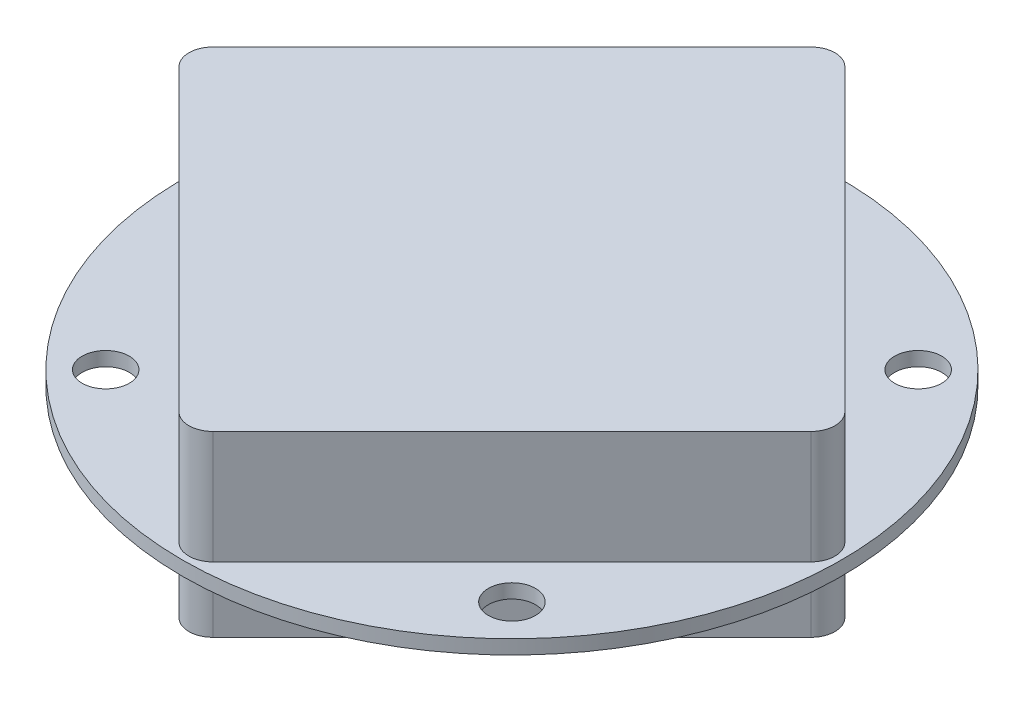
from build123d import *

# Parameters (mm, degrees)
SKETCH1_R                  = 17.5
BOSS_EXTRUDE1_DEPTH        = 0.75
BOSS_EXTRUDE2_DEPTH        = 6
BOSS_EXTRUDE3_START        = 2.72
BOSS_EXTRUDE3_DEPTH        = 2.72
F_2_5_2_5_DIAMETER_HOLE1_D = 2.5


with BuildPart() as part:
    # Sketch1 → Boss-Extrude1 (new body)
    with BuildSketch(Plane(origin=(0, 0, 0), x_dir=(1, 0, 0), z_dir=(0, 1, 0))):
        with Locations(Location((0, 0, 0), (0, 0, 270))):
            Circle(SKETCH1_R)
    extrude(amount=BOSS_EXTRUDE1_DEPTH)

    # Sketch2 → Boss-Extrude2 (add)
    with BuildSketch(Plane(origin=(0, 0.75, 0), x_dir=(1, 0, 0), z_dir=(0, 1, 0))):
        with BuildLine():
            Line((-16.779643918, 0.898025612), (-0.898025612, 16.779643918))
            ThreePointArc((-0.898025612, 16.779643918), (0, 17.151618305), (0.898025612, 16.779643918))
            Line((0.898025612, 16.779643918), (16.779643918, 0.898025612))
            ThreePointArc((16.779643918, 0.898025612), (17.151618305, 0), (16.779643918, -0.898025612))
            Line((16.779643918, -0.898025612), (0.898025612, -16.779643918))
            ThreePointArc((0.898025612, -16.779643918), (0, -17.151618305), (-0.898025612, -16.779643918))
            Line((-0.898025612, -16.779643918), (-16.779643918, -0.898025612))
            ThreePointArc((-16.779643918, -0.898025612), (-17.151618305, 0), (-16.779643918, 0.898025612))
        make_face()
    extrude(amount=BOSS_EXTRUDE2_DEPTH)

    # Sketch3 → Boss-Extrude3 (add)
    with BuildSketch(Plane.XZ.offset(BOSS_EXTRUDE3_START)):
        with BuildLine():
            Line((16.779643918, -0.898025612), (0.898025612, -16.779643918))
            ThreePointArc((0.898025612, -16.779643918), (0, -17.151618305), (-0.898025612, -16.779643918))
            Line((-0.898025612, -16.779643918), (-16.779643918, -0.898025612))
            ThreePointArc((-16.779643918, -0.898025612), (-17.151618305, 0), (-16.779643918, 0.898025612))
            Line((-16.779643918, 0.898025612), (-0.898025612, 16.779643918))
            ThreePointArc((-0.898025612, 16.779643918), (0, 17.151618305), (0.898025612, 16.779643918))
            Line((0.898025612, 16.779643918), (16.779643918, 0.898025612))
            ThreePointArc((16.779643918, 0.898025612), (17.151618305, 0), (16.779643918, -0.898025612))
        make_face()
    extrude(amount=-BOSS_EXTRUDE3_DEPTH)

    # 2.5 _2.5_ Diameter Hole1 (through all)
    with Locations(Plane(origin=(0, 0.75, 0), x_dir=(1, 0, 0), z_dir=(0, 1, 0))):
        with Locations((-10.680463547, 10.680463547), (10.785449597, 10.785449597), (10.680463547, -10.680463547), (-10.785449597, -10.785449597)):
            Hole(F_2_5_2_5_DIAMETER_HOLE1_D / 2)


solid = part.part
